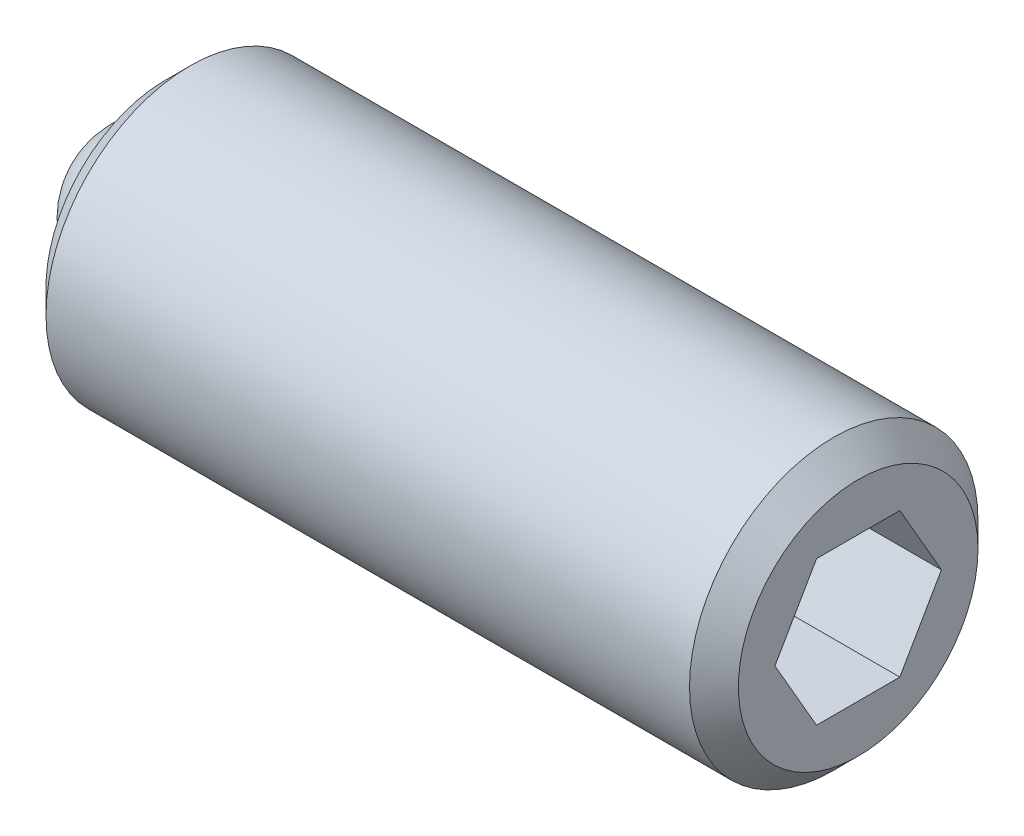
ISO-10303-21;
HEADER;
FILE_DESCRIPTION(('STEP AP214'),'2;1');
FILE_NAME('part.step','',(''),(''),'','','');
FILE_SCHEMA(('AUTOMOTIVE_DESIGN { 1 0 10303 214 1 1 1 1 }'));
ENDSEC;
DATA;
#1=APPLICATION_CONTEXT('core data for automotive mechanical design processes');
#2=APPLICATION_PROTOCOL_DEFINITION('international standard','automotive_design',2000,#1);
#3=PRODUCT_CONTEXT('',#1,'mechanical');
#4=PRODUCT('Part','Part','',(#3));
#5=PRODUCT_RELATED_PRODUCT_CATEGORY('part','',(#4));
#6=PRODUCT_DEFINITION_FORMATION('','',#4);
#7=PRODUCT_DEFINITION_CONTEXT('part definition',#1,'design');
#8=PRODUCT_DEFINITION('design','',#6,#7);
#9=PRODUCT_DEFINITION_SHAPE('','',#8);
#10=(LENGTH_UNIT() NAMED_UNIT(*) SI_UNIT(.MILLI.,.METRE.));
#11=(NAMED_UNIT(*) PLANE_ANGLE_UNIT() SI_UNIT($,.RADIAN.));
#12=(NAMED_UNIT(*) SI_UNIT($,.STERADIAN.) SOLID_ANGLE_UNIT());
#13=UNCERTAINTY_MEASURE_WITH_UNIT(LENGTH_MEASURE(1.E-05),#10,'distance_accuracy_value','');
#14=(GEOMETRIC_REPRESENTATION_CONTEXT(3) GLOBAL_UNCERTAINTY_ASSIGNED_CONTEXT((#13)) GLOBAL_UNIT_ASSIGNED_CONTEXT((#10,
#11,#12)) REPRESENTATION_CONTEXT('',''));
#15=CARTESIAN_POINT('',(0.,0.,0.));
#16=DIRECTION('',(0.,0.,1.));
#17=DIRECTION('',(1.,0.,0.));
#18=AXIS2_PLACEMENT_3D('',#15,#16,#17);
#19=CARTESIAN_POINT('',(0.,0.,0.));
#20=DIRECTION('',(0.,-1.,0.));
#21=DIRECTION('',(0.,0.,-1.));
#22=AXIS2_PLACEMENT_3D('',#19,#20,#21);
#23=SPHERICAL_SURFACE('',#22,0.8);
#24=CARTESIAN_POINT('',(0.,-0.8,0.));
#25=VERTEX_POINT('',#24);
#26=VERTEX_LOOP('',#25);
#27=FACE_BOUND('',#26,.T.);
#28=ADVANCED_FACE('F41',(#27),#23,.T.);
#29=CLOSED_SHELL('',(#28));
#30=MANIFOLD_SOLID_BREP('B2',#29);
#31=CARTESIAN_POINT('',(7.2,0.,0.));
#32=DIRECTION('',(-1.,0.,0.));
#33=DIRECTION('',(0.,0.,1.));
#34=AXIS2_PLACEMENT_3D('',#31,#32,#33);
#35=CYLINDRICAL_SURFACE('',#34,1.5);
#36=CARTESIAN_POINT('',(6.946,0.,0.));
#37=DIRECTION('',(1.,0.,0.));
#38=DIRECTION('',(0.,0.,-1.));
#39=AXIS2_PLACEMENT_3D('',#36,#37,#38);
#40=CIRCLE('',#39,1.5);
#41=CARTESIAN_POINT('',(6.946,0.,-1.5));
#42=VERTEX_POINT('',#41);
#43=EDGE_CURVE('E39',#42,#42,#40,.F.);
#44=ORIENTED_EDGE('',*,*,#43,.T.);
#45=EDGE_LOOP('',(#44));
#46=FACE_BOUND('',#45,.T.);
#47=CARTESIAN_POINT('',(0.253999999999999,0.,0.));
#48=DIRECTION('',(1.,0.,0.));
#49=DIRECTION('',(0.,0.,-1.));
#50=AXIS2_PLACEMENT_3D('',#47,#48,#49);
#51=CIRCLE('',#50,1.5);
#52=CARTESIAN_POINT('',(0.253999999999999,0.,-1.5));
#53=VERTEX_POINT('',#52);
#54=EDGE_CURVE('E174',#53,#53,#51,.T.);
#55=ORIENTED_EDGE('',*,*,#54,.T.);
#56=EDGE_LOOP('',(#55));
#57=FACE_BOUND('',#56,.T.);
#58=ADVANCED_FACE('F52',(#46,#57),#35,.T.);
#59=CARTESIAN_POINT('',(7.2,0.,0.));
#60=DIRECTION('',(1.,0.,0.));
#61=DIRECTION('',(0.,0.,-1.));
#62=AXIS2_PLACEMENT_3D('',#59,#60,#61);
#63=PLANE('',#62);
#64=DIRECTION('',(0.,0.866025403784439,-0.5));
#65=VECTOR('',#64,1.);
#66=CARTESIAN_POINT('',(7.2,-0.75,-0.43301270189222));
#67=LINE('',#66,#65);
#68=CARTESIAN_POINT('',(7.2,-0.75,-0.43301270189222));
#69=VERTEX_POINT('',#68);
#70=CARTESIAN_POINT('',(7.2,0.,-0.866025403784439));
#71=VERTEX_POINT('',#70);
#72=EDGE_CURVE('E75',#69,#71,#67,.T.);
#73=ORIENTED_EDGE('',*,*,#72,.F.);
#74=DIRECTION('',(0.,0.,-1.));
#75=VECTOR('',#74,1.);
#76=CARTESIAN_POINT('',(7.2,-0.75,0.433012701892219));
#77=LINE('',#76,#75);
#78=CARTESIAN_POINT('',(7.2,-0.75,0.433012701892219));
#79=VERTEX_POINT('',#78);
#80=EDGE_CURVE('E141',#79,#69,#77,.T.);
#81=ORIENTED_EDGE('',*,*,#80,.F.);
#82=DIRECTION('',(0.,-0.866025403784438,-0.5));
#83=VECTOR('',#82,1.);
#84=CARTESIAN_POINT('',(7.2,0.,0.866025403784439));
#85=LINE('',#84,#83);
#86=CARTESIAN_POINT('',(7.2,0.,0.866025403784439));
#87=VERTEX_POINT('',#86);
#88=EDGE_CURVE('E167',#87,#79,#85,.T.);
#89=ORIENTED_EDGE('',*,*,#88,.F.);
#90=DIRECTION('',(0.,-0.866025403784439,0.5));
#91=VECTOR('',#90,1.);
#92=CARTESIAN_POINT('',(7.2,0.75,0.433012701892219));
#93=LINE('',#92,#91);
#94=CARTESIAN_POINT('',(7.2,0.75,0.433012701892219));
#95=VERTEX_POINT('',#94);
#96=EDGE_CURVE('E164',#95,#87,#93,.T.);
#97=ORIENTED_EDGE('',*,*,#96,.F.);
#98=DIRECTION('',(0.,0.,1.));
#99=VECTOR('',#98,1.);
#100=CARTESIAN_POINT('',(7.2,0.75,-0.433012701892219));
#101=LINE('',#100,#99);
#102=CARTESIAN_POINT('',(7.2,0.75,-0.433012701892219));
#103=VERTEX_POINT('',#102);
#104=EDGE_CURVE('E161',#103,#95,#101,.T.);
#105=ORIENTED_EDGE('',*,*,#104,.F.);
#106=DIRECTION('',(0.,0.866025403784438,0.5));
#107=VECTOR('',#106,1.);
#108=CARTESIAN_POINT('',(7.2,0.,-0.866025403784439));
#109=LINE('',#108,#107);
#110=EDGE_CURVE('E158',#71,#103,#109,.T.);
#111=ORIENTED_EDGE('',*,*,#110,.F.);
#112=EDGE_LOOP('',(#73,#81,#89,#97,#105,#111));
#113=FACE_BOUND('',#112,.T.);
#114=CARTESIAN_POINT('',(7.2,0.,0.));
#115=DIRECTION('',(1.,0.,0.));
#116=DIRECTION('',(0.,0.,-1.));
#117=AXIS2_PLACEMENT_3D('',#114,#115,#116);
#118=CIRCLE('',#117,1.246);
#119=CARTESIAN_POINT('',(7.2,0.,-1.246));
#120=VERTEX_POINT('',#119);
#121=EDGE_CURVE('E60',#120,#120,#118,.T.);
#122=ORIENTED_EDGE('',*,*,#121,.T.);
#123=EDGE_LOOP('',(#122));
#124=FACE_BOUND('',#123,.T.);
#125=ADVANCED_FACE('F191',(#113,#124),#63,.T.);
#126=CARTESIAN_POINT('',(0.,0.,0.));
#127=DIRECTION('',(1.,0.,0.));
#128=DIRECTION('',(0.,0.,-1.));
#129=AXIS2_PLACEMENT_3D('',#126,#127,#128);
#130=PLANE('',#129);
#131=CARTESIAN_POINT('',(0.,0.,0.));
#132=DIRECTION('',(-1.,0.,0.));
#133=DIRECTION('',(0.,0.,1.));
#134=AXIS2_PLACEMENT_3D('',#131,#132,#133);
#135=CIRCLE('',#134,0.8);
#136=CARTESIAN_POINT('',(0.,0.79747984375,-0.0634499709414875));
#137=VERTEX_POINT('',#136);
#138=CARTESIAN_POINT('',(0.,0.79747984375,0.0634499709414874));
#139=VERTEX_POINT('',#138);
#140=EDGE_CURVE('E126',#137,#139,#135,.T.);
#141=ORIENTED_EDGE('',*,*,#140,.F.);
#142=CARTESIAN_POINT('',(0.,0.8,0.));
#143=DIRECTION('',(-1.,0.,0.));
#144=DIRECTION('',(0.,0.,1.));
#145=AXIS2_PLACEMENT_3D('',#142,#143,#144);
#146=CIRCLE('',#145,0.0635000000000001);
#147=EDGE_CURVE('E115',#139,#137,#146,.T.);
#148=ORIENTED_EDGE('',*,*,#147,.F.);
#149=EDGE_LOOP('',(#141,#148));
#150=FACE_BOUND('',#149,.T.);
#151=CARTESIAN_POINT('',(0.,0.,0.));
#152=DIRECTION('',(1.,0.,0.));
#153=DIRECTION('',(0.,0.,-1.));
#154=AXIS2_PLACEMENT_3D('',#151,#152,#153);
#155=CIRCLE('',#154,1.246);
#156=CARTESIAN_POINT('',(0.,0.,-1.246));
#157=VERTEX_POINT('',#156);
#158=EDGE_CURVE('E186',#157,#157,#155,.F.);
#159=ORIENTED_EDGE('',*,*,#158,.T.);
#160=EDGE_LOOP('',(#159));
#161=FACE_BOUND('',#160,.T.);
#162=ADVANCED_FACE('F130',(#150,#161),#130,.F.);
#163=CARTESIAN_POINT('',(0.253999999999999,0.,0.));
#164=DIRECTION('',(1.,0.,0.));
#165=DIRECTION('',(0.,0.,-1.));
#166=AXIS2_PLACEMENT_3D('',#163,#164,#165);
#167=CONICAL_SURFACE('',#166,1.5,0.785398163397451);
#168=ORIENTED_EDGE('',*,*,#158,.F.);
#169=EDGE_LOOP('',(#168));
#170=FACE_BOUND('',#169,.T.);
#171=ORIENTED_EDGE('',*,*,#54,.F.);
#172=EDGE_LOOP('',(#171));
#173=FACE_BOUND('',#172,.T.);
#174=ADVANCED_FACE('F195',(#170,#173),#167,.T.);
#175=CARTESIAN_POINT('',(7.2,0.,0.));
#176=DIRECTION('',(-1.,0.,0.));
#177=DIRECTION('',(0.,0.,1.));
#178=AXIS2_PLACEMENT_3D('',#175,#176,#177);
#179=CONICAL_SURFACE('',#178,1.246,0.785398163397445);
#180=ORIENTED_EDGE('',*,*,#43,.F.);
#181=EDGE_LOOP('',(#180));
#182=FACE_BOUND('',#181,.T.);
#183=ORIENTED_EDGE('',*,*,#121,.F.);
#184=EDGE_LOOP('',(#183));
#185=FACE_BOUND('',#184,.T.);
#186=ADVANCED_FACE('F54',(#182,#185),#179,.T.);
#187=CARTESIAN_POINT('',(5.2,-0.75,-0.43301270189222));
#188=DIRECTION('',(0.,-0.5,-0.866025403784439));
#189=DIRECTION('',(0.,0.866025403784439,-0.5));
#190=AXIS2_PLACEMENT_3D('',#187,#188,#189);
#191=PLANE('',#190);
#192=ORIENTED_EDGE('',*,*,#72,.T.);
#193=DIRECTION('',(1.,0.,0.));
#194=VECTOR('',#193,1.);
#195=CARTESIAN_POINT('',(5.2,0.,-0.866025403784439));
#196=LINE('',#195,#194);
#197=CARTESIAN_POINT('',(5.2,0.,-0.866025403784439));
#198=VERTEX_POINT('',#197);
#199=EDGE_CURVE('E156',#198,#71,#196,.T.);
#200=ORIENTED_EDGE('',*,*,#199,.F.);
#201=DIRECTION('',(0.,0.866025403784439,-0.5));
#202=VECTOR('',#201,1.);
#203=CARTESIAN_POINT('',(5.2,-0.75,-0.43301270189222));
#204=LINE('',#203,#202);
#205=CARTESIAN_POINT('',(5.2,-0.75,-0.43301270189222));
#206=VERTEX_POINT('',#205);
#207=EDGE_CURVE('E137',#206,#198,#204,.T.);
#208=ORIENTED_EDGE('',*,*,#207,.F.);
#209=DIRECTION('',(1.,0.,0.));
#210=VECTOR('',#209,1.);
#211=CARTESIAN_POINT('',(5.2,-0.75,-0.43301270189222));
#212=LINE('',#211,#210);
#213=EDGE_CURVE('E172',#206,#69,#212,.T.);
#214=ORIENTED_EDGE('',*,*,#213,.T.);
#215=EDGE_LOOP('',(#192,#200,#208,#214));
#216=FACE_BOUND('',#215,.T.);
#217=ADVANCED_FACE('F194',(#216),#191,.F.);
#218=CARTESIAN_POINT('',(5.2,-0.75,0.433012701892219));
#219=DIRECTION('',(0.,-1.,0.));
#220=DIRECTION('',(0.,0.,-1.));
#221=AXIS2_PLACEMENT_3D('',#218,#219,#220);
#222=PLANE('',#221);
#223=ORIENTED_EDGE('',*,*,#80,.T.);
#224=ORIENTED_EDGE('',*,*,#213,.F.);
#225=DIRECTION('',(0.,0.,-1.));
#226=VECTOR('',#225,1.);
#227=CARTESIAN_POINT('',(5.2,-0.75,0.433012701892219));
#228=LINE('',#227,#226);
#229=CARTESIAN_POINT('',(5.2,-0.75,0.433012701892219));
#230=VERTEX_POINT('',#229);
#231=EDGE_CURVE('E153',#230,#206,#228,.T.);
#232=ORIENTED_EDGE('',*,*,#231,.F.);
#233=DIRECTION('',(1.,0.,0.));
#234=VECTOR('',#233,1.);
#235=CARTESIAN_POINT('',(5.2,-0.75,0.433012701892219));
#236=LINE('',#235,#234);
#237=EDGE_CURVE('E175',#230,#79,#236,.T.);
#238=ORIENTED_EDGE('',*,*,#237,.T.);
#239=EDGE_LOOP('',(#223,#224,#232,#238));
#240=FACE_BOUND('',#239,.T.);
#241=ADVANCED_FACE('F201',(#240),#222,.F.);
#242=CARTESIAN_POINT('',(5.2,0.,0.866025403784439));
#243=DIRECTION('',(0.,-0.5,0.866025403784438));
#244=DIRECTION('',(0.,-0.866025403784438,-0.5));
#245=AXIS2_PLACEMENT_3D('',#242,#243,#244);
#246=PLANE('',#245);
#247=ORIENTED_EDGE('',*,*,#88,.T.);
#248=ORIENTED_EDGE('',*,*,#237,.F.);
#249=DIRECTION('',(0.,-0.866025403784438,-0.5));
#250=VECTOR('',#249,1.);
#251=CARTESIAN_POINT('',(5.2,0.,0.866025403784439));
#252=LINE('',#251,#250);
#253=CARTESIAN_POINT('',(5.2,0.,0.866025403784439));
#254=VERTEX_POINT('',#253);
#255=EDGE_CURVE('E150',#254,#230,#252,.T.);
#256=ORIENTED_EDGE('',*,*,#255,.F.);
#257=DIRECTION('',(1.,0.,0.));
#258=VECTOR('',#257,1.);
#259=CARTESIAN_POINT('',(5.2,0.,0.866025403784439));
#260=LINE('',#259,#258);
#261=EDGE_CURVE('E177',#254,#87,#260,.T.);
#262=ORIENTED_EDGE('',*,*,#261,.T.);
#263=EDGE_LOOP('',(#247,#248,#256,#262));
#264=FACE_BOUND('',#263,.T.);
#265=ADVANCED_FACE('F229',(#264),#246,.F.);
#266=CARTESIAN_POINT('',(5.2,0.75,0.433012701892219));
#267=DIRECTION('',(0.,0.5,0.866025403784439));
#268=DIRECTION('',(0.,-0.866025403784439,0.5));
#269=AXIS2_PLACEMENT_3D('',#266,#267,#268);
#270=PLANE('',#269);
#271=ORIENTED_EDGE('',*,*,#96,.T.);
#272=ORIENTED_EDGE('',*,*,#261,.F.);
#273=DIRECTION('',(0.,-0.866025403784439,0.5));
#274=VECTOR('',#273,1.);
#275=CARTESIAN_POINT('',(5.2,0.75,0.433012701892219));
#276=LINE('',#275,#274);
#277=CARTESIAN_POINT('',(5.2,0.75,0.433012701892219));
#278=VERTEX_POINT('',#277);
#279=EDGE_CURVE('E147',#278,#254,#276,.T.);
#280=ORIENTED_EDGE('',*,*,#279,.F.);
#281=DIRECTION('',(1.,0.,0.));
#282=VECTOR('',#281,1.);
#283=CARTESIAN_POINT('',(5.2,0.75,0.433012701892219));
#284=LINE('',#283,#282);
#285=EDGE_CURVE('E179',#278,#95,#284,.T.);
#286=ORIENTED_EDGE('',*,*,#285,.T.);
#287=EDGE_LOOP('',(#271,#272,#280,#286));
#288=FACE_BOUND('',#287,.T.);
#289=ADVANCED_FACE('F225',(#288),#270,.F.);
#290=CARTESIAN_POINT('',(5.2,0.75,-0.433012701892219));
#291=DIRECTION('',(0.,1.,0.));
#292=DIRECTION('',(0.,0.,1.));
#293=AXIS2_PLACEMENT_3D('',#290,#291,#292);
#294=PLANE('',#293);
#295=ORIENTED_EDGE('',*,*,#104,.T.);
#296=ORIENTED_EDGE('',*,*,#285,.F.);
#297=DIRECTION('',(0.,0.,1.));
#298=VECTOR('',#297,1.);
#299=CARTESIAN_POINT('',(5.2,0.75,-0.433012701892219));
#300=LINE('',#299,#298);
#301=CARTESIAN_POINT('',(5.2,0.75,-0.433012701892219));
#302=VERTEX_POINT('',#301);
#303=EDGE_CURVE('E144',#302,#278,#300,.T.);
#304=ORIENTED_EDGE('',*,*,#303,.F.);
#305=DIRECTION('',(1.,0.,0.));
#306=VECTOR('',#305,1.);
#307=CARTESIAN_POINT('',(5.2,0.75,-0.433012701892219));
#308=LINE('',#307,#306);
#309=EDGE_CURVE('E181',#302,#103,#308,.T.);
#310=ORIENTED_EDGE('',*,*,#309,.T.);
#311=EDGE_LOOP('',(#295,#296,#304,#310));
#312=FACE_BOUND('',#311,.T.);
#313=ADVANCED_FACE('F221',(#312),#294,.F.);
#314=CARTESIAN_POINT('',(5.2,0.,-0.866025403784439));
#315=DIRECTION('',(0.,0.500000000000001,-0.866025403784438));
#316=DIRECTION('',(0.,0.866025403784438,0.500000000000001));
#317=AXIS2_PLACEMENT_3D('',#314,#315,#316);
#318=PLANE('',#317);
#319=ORIENTED_EDGE('',*,*,#110,.T.);
#320=ORIENTED_EDGE('',*,*,#309,.F.);
#321=DIRECTION('',(0.,0.866025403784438,0.5));
#322=VECTOR('',#321,1.);
#323=CARTESIAN_POINT('',(5.2,0.,-0.866025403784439));
#324=LINE('',#323,#322);
#325=EDGE_CURVE('E140',#198,#302,#324,.T.);
#326=ORIENTED_EDGE('',*,*,#325,.F.);
#327=ORIENTED_EDGE('',*,*,#199,.T.);
#328=EDGE_LOOP('',(#319,#320,#326,#327));
#329=FACE_BOUND('',#328,.T.);
#330=ADVANCED_FACE('F217',(#329),#318,.F.);
#331=CARTESIAN_POINT('',(5.2,0.,0.));
#332=DIRECTION('',(1.,0.,0.));
#333=DIRECTION('',(0.,0.,-1.));
#334=AXIS2_PLACEMENT_3D('',#331,#332,#333);
#335=PLANE('',#334);
#336=ORIENTED_EDGE('',*,*,#207,.T.);
#337=ORIENTED_EDGE('',*,*,#325,.T.);
#338=ORIENTED_EDGE('',*,*,#303,.T.);
#339=ORIENTED_EDGE('',*,*,#279,.T.);
#340=ORIENTED_EDGE('',*,*,#255,.T.);
#341=ORIENTED_EDGE('',*,*,#231,.T.);
#342=EDGE_LOOP('',(#336,#337,#338,#339,#340,#341));
#343=FACE_BOUND('',#342,.T.);
#344=ADVANCED_FACE('F220',(#343),#335,.T.);
#345=CARTESIAN_POINT('',(0.8,0.,0.));
#346=DIRECTION('',(-1.,0.,0.));
#347=DIRECTION('',(0.,0.,1.));
#348=AXIS2_PLACEMENT_3D('',#345,#346,#347);
#349=CYLINDRICAL_SURFACE('',#348,0.8);
#350=CARTESIAN_POINT('',(0.8,0.,0.));
#351=DIRECTION('',(-1.,0.,0.));
#352=DIRECTION('',(0.,0.,1.));
#353=AXIS2_PLACEMENT_3D('',#350,#351,#352);
#354=CIRCLE('',#353,0.8);
#355=CARTESIAN_POINT('',(0.8,0.79747984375,-0.0634499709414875));
#356=VERTEX_POINT('',#355);
#357=CARTESIAN_POINT('',(0.8,0.79747984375,0.0634499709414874));
#358=VERTEX_POINT('',#357);
#359=EDGE_CURVE('E128',#356,#358,#354,.T.);
#360=ORIENTED_EDGE('',*,*,#359,.F.);
#361=DIRECTION('',(-1.,0.,0.));
#362=VECTOR('',#361,1.);
#363=CARTESIAN_POINT('',(0.94313511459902,0.79747984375,-0.0634499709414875));
#364=LINE('',#363,#362);
#365=EDGE_CURVE('E67',#356,#137,#364,.T.);
#366=ORIENTED_EDGE('',*,*,#365,.T.);
#367=ORIENTED_EDGE('',*,*,#140,.T.);
#368=DIRECTION('',(-1.,0.,0.));
#369=VECTOR('',#368,1.);
#370=CARTESIAN_POINT('',(0.94313511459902,0.79747984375,0.0634499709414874));
#371=LINE('',#370,#369);
#372=EDGE_CURVE('E118',#358,#139,#371,.T.);
#373=ORIENTED_EDGE('',*,*,#372,.F.);
#374=EDGE_LOOP('',(#360,#366,#367,#373));
#375=FACE_BOUND('',#374,.T.);
#376=ADVANCED_FACE('F125',(#375),#349,.F.);
#377=CARTESIAN_POINT('',(0.8,0.,0.));
#378=DIRECTION('',(-1.,0.,0.));
#379=DIRECTION('',(0.,0.,1.));
#380=AXIS2_PLACEMENT_3D('',#377,#378,#379);
#381=PLANE('',#380);
#382=ORIENTED_EDGE('',*,*,#359,.T.);
#383=CARTESIAN_POINT('',(0.8,0.8,0.));
#384=DIRECTION('',(-1.,0.,0.));
#385=DIRECTION('',(0.,0.,1.));
#386=AXIS2_PLACEMENT_3D('',#383,#384,#385);
#387=CIRCLE('',#386,0.0635000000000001);
#388=EDGE_CURVE('E132',#356,#358,#387,.F.);
#389=ORIENTED_EDGE('',*,*,#388,.F.);
#390=EDGE_LOOP('',(#382,#389));
#391=FACE_BOUND('',#390,.T.);
#392=ADVANCED_FACE('F242',(#391),#381,.T.);
#393=CARTESIAN_POINT('',(0.94313511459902,0.8,0.));
#394=DIRECTION('',(-1.,0.,0.));
#395=DIRECTION('',(0.,0.,1.));
#396=AXIS2_PLACEMENT_3D('',#393,#394,#395);
#397=CYLINDRICAL_SURFACE('',#396,0.0635000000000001);
#398=ORIENTED_EDGE('',*,*,#388,.T.);
#399=ORIENTED_EDGE('',*,*,#372,.T.);
#400=ORIENTED_EDGE('',*,*,#147,.T.);
#401=ORIENTED_EDGE('',*,*,#365,.F.);
#402=EDGE_LOOP('',(#398,#399,#400,#401));
#403=FACE_BOUND('',#402,.T.);
#404=ADVANCED_FACE('F116',(#403),#397,.F.);
#405=CLOSED_SHELL('',(#58,#125,#162,#174,#186,#217,#241,#265,#289,#313,#330,#344,#376,#392,#404));
#406=MANIFOLD_SOLID_BREP('B6',#405);
#407=ADVANCED_BREP_SHAPE_REPRESENTATION('',(#18,#30,#406),#14);
#408=SHAPE_DEFINITION_REPRESENTATION(#9,#407);
ENDSEC;
END-ISO-10303-21;
